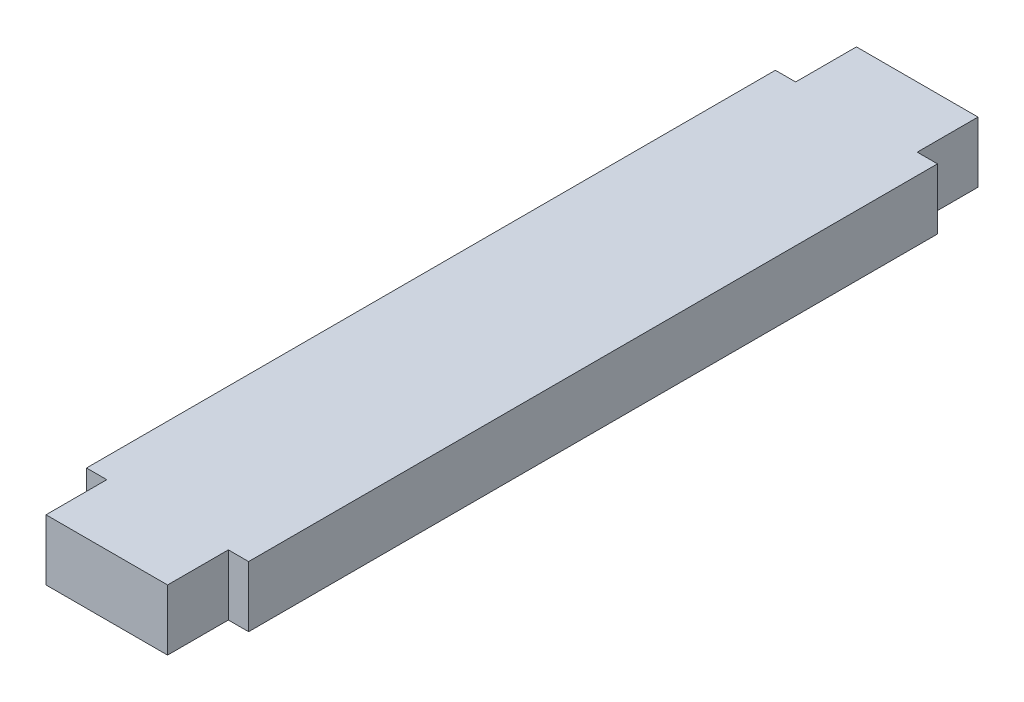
from build123d import *

# Parameters (mm, degrees)
BOSS_EXTRUDE1_DEPTH = 15


with BuildPart() as part:
    # Sketch1 → Boss-Extrude1 (new body)
    with BuildSketch(Plane(origin=(0, 0, 0), x_dir=(1, 0, 0), z_dir=(0, 1, 0))):
        Polygon((0, 0), (30, 0), (30, 15), (35, 15), (35, 185), (30, 185), (30, 200), (0, 200), (0, 185), (-5, 185), (-5, 15), (0, 15), align=None)
    extrude(amount=BOSS_EXTRUDE1_DEPTH)


solid = part.part
